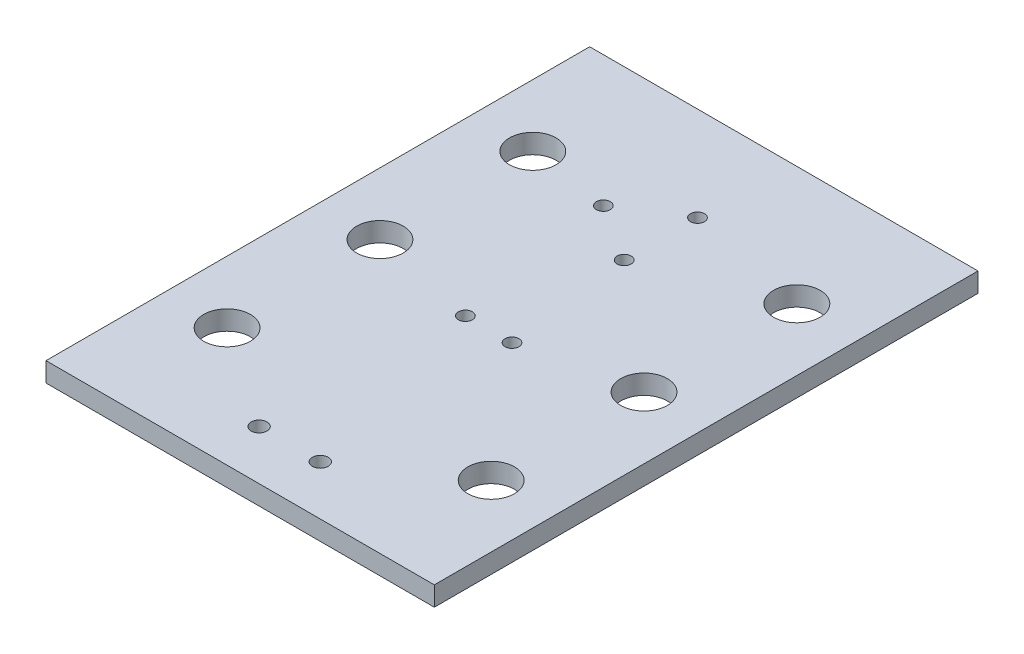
ISO-10303-21;
HEADER;
FILE_DESCRIPTION(('STEP AP214'),'2;1');
FILE_NAME('part.step','',(''),(''),'','','');
FILE_SCHEMA(('AUTOMOTIVE_DESIGN { 1 0 10303 214 1 1 1 1 }'));
ENDSEC;
DATA;
#1=APPLICATION_CONTEXT('core data for automotive mechanical design processes');
#2=APPLICATION_PROTOCOL_DEFINITION('international standard','automotive_design',2000,#1);
#3=PRODUCT_CONTEXT('',#1,'mechanical');
#4=PRODUCT('Part','Part','',(#3));
#5=PRODUCT_RELATED_PRODUCT_CATEGORY('part','',(#4));
#6=PRODUCT_DEFINITION_FORMATION('','',#4);
#7=PRODUCT_DEFINITION_CONTEXT('part definition',#1,'design');
#8=PRODUCT_DEFINITION('design','',#6,#7);
#9=PRODUCT_DEFINITION_SHAPE('','',#8);
#10=(LENGTH_UNIT() NAMED_UNIT(*) SI_UNIT(.MILLI.,.METRE.));
#11=(NAMED_UNIT(*) PLANE_ANGLE_UNIT() SI_UNIT($,.RADIAN.));
#12=(NAMED_UNIT(*) SI_UNIT($,.STERADIAN.) SOLID_ANGLE_UNIT());
#13=UNCERTAINTY_MEASURE_WITH_UNIT(LENGTH_MEASURE(1.E-05),#10,'distance_accuracy_value','');
#14=(GEOMETRIC_REPRESENTATION_CONTEXT(3) GLOBAL_UNCERTAINTY_ASSIGNED_CONTEXT((#13)) GLOBAL_UNIT_ASSIGNED_CONTEXT((#10,
#11,#12)) REPRESENTATION_CONTEXT('',''));
#15=CARTESIAN_POINT('',(0.,0.,0.));
#16=DIRECTION('',(0.,0.,1.));
#17=DIRECTION('',(1.,0.,0.));
#18=AXIS2_PLACEMENT_3D('',#15,#16,#17);
#19=CARTESIAN_POINT('',(0.,1.5875,0.));
#20=DIRECTION('',(0.,1.,0.));
#21=DIRECTION('',(0.,0.,1.));
#22=AXIS2_PLACEMENT_3D('',#19,#20,#21);
#23=PLANE('',#22);
#24=CARTESIAN_POINT('',(10.795,1.5875,-9.72566));
#25=DIRECTION('',(0.,1.,0.));
#26=DIRECTION('',(0.,0.,-1.));
#27=AXIS2_PLACEMENT_3D('',#24,#25,#26);
#28=CIRCLE('',#27,1.905);
#29=CARTESIAN_POINT('',(10.795,1.5875,-11.63066));
#30=VERTEX_POINT('',#29);
#31=EDGE_CURVE('E175',#30,#30,#28,.T.);
#32=ORIENTED_EDGE('',*,*,#31,.F.);
#33=EDGE_LOOP('',(#32));
#34=FACE_BOUND('',#33,.T.);
#35=CARTESIAN_POINT('',(1.90499999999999,1.5875,-20.32));
#36=DIRECTION('',(0.,1.,0.));
#37=DIRECTION('',(0.,0.,-1.));
#38=AXIS2_PLACEMENT_3D('',#35,#36,#37);
#39=CIRCLE('',#38,0.5715);
#40=CARTESIAN_POINT('',(1.90499999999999,1.5875,-20.8915));
#41=VERTEX_POINT('',#40);
#42=EDGE_CURVE('E163',#41,#41,#39,.T.);
#43=ORIENTED_EDGE('',*,*,#42,.F.);
#44=EDGE_LOOP('',(#43));
#45=FACE_BOUND('',#44,.T.);
#46=CARTESIAN_POINT('',(0.635,1.5875,-36.7538));
#47=DIRECTION('',(0.,1.,0.));
#48=DIRECTION('',(0.,0.,1.));
#49=AXIS2_PLACEMENT_3D('',#46,#47,#48);
#50=CIRCLE('',#49,0.571500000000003);
#51=CARTESIAN_POINT('',(0.635,1.5875,-36.1823));
#52=VERTEX_POINT('',#51);
#53=EDGE_CURVE('E151',#52,#52,#50,.T.);
#54=ORIENTED_EDGE('',*,*,#53,.F.);
#55=EDGE_LOOP('',(#54));
#56=FACE_BOUND('',#55,.T.);
#57=CARTESIAN_POINT('',(0.635,1.5875,-30.7594));
#58=DIRECTION('',(0.,1.,0.));
#59=DIRECTION('',(0.,0.,1.));
#60=AXIS2_PLACEMENT_3D('',#57,#58,#59);
#61=CIRCLE('',#60,0.5715);
#62=CARTESIAN_POINT('',(0.635,1.5875,-30.1879));
#63=VERTEX_POINT('',#62);
#64=EDGE_CURVE('E139',#63,#63,#61,.T.);
#65=ORIENTED_EDGE('',*,*,#64,.F.);
#66=EDGE_LOOP('',(#65));
#67=FACE_BOUND('',#66,.T.);
#68=CARTESIAN_POINT('',(-2.49936,1.5875,-4.04876));
#69=DIRECTION('',(0.,1.,0.));
#70=DIRECTION('',(0.,0.,1.));
#71=AXIS2_PLACEMENT_3D('',#68,#69,#70);
#72=CIRCLE('',#71,0.6477);
#73=CARTESIAN_POINT('',(-2.49936,1.5875,-3.40106));
#74=VERTEX_POINT('',#73);
#75=EDGE_CURVE('E127',#74,#74,#72,.T.);
#76=ORIENTED_EDGE('',*,*,#75,.F.);
#77=EDGE_LOOP('',(#76));
#78=FACE_BOUND('',#77,.T.);
#79=CARTESIAN_POINT('',(-10.795,1.5875,-22.225));
#80=DIRECTION('',(0.,1.,0.));
#81=DIRECTION('',(0.,0.,1.));
#82=AXIS2_PLACEMENT_3D('',#79,#80,#81);
#83=CIRCLE('',#82,1.905);
#84=CARTESIAN_POINT('',(-10.795,1.5875,-20.32));
#85=VERTEX_POINT('',#84);
#86=EDGE_CURVE('E115',#85,#85,#83,.T.);
#87=ORIENTED_EDGE('',*,*,#86,.F.);
#88=EDGE_LOOP('',(#87));
#89=FACE_BOUND('',#88,.T.);
#90=DIRECTION('',(0.,0.,1.));
#91=VECTOR('',#90,1.);
#92=CARTESIAN_POINT('',(-15.875,1.5875,-44.45));
#93=LINE('',#92,#91);
#94=CARTESIAN_POINT('',(-15.875,1.5875,-44.45));
#95=VERTEX_POINT('',#94);
#96=CARTESIAN_POINT('',(-15.875,1.5875,0.));
#97=VERTEX_POINT('',#96);
#98=EDGE_CURVE('E85',#95,#97,#93,.T.);
#99=ORIENTED_EDGE('',*,*,#98,.T.);
#100=DIRECTION('',(1.,0.,0.));
#101=VECTOR('',#100,1.);
#102=CARTESIAN_POINT('',(-15.875,1.5875,0.));
#103=LINE('',#102,#101);
#104=CARTESIAN_POINT('',(15.875,1.5875,0.));
#105=VERTEX_POINT('',#104);
#106=EDGE_CURVE('E80',#97,#105,#103,.T.);
#107=ORIENTED_EDGE('',*,*,#106,.T.);
#108=DIRECTION('',(0.,0.,-1.));
#109=VECTOR('',#108,1.);
#110=CARTESIAN_POINT('',(15.875,1.5875,-44.45));
#111=LINE('',#110,#109);
#112=CARTESIAN_POINT('',(15.875,1.5875,-44.45));
#113=VERTEX_POINT('',#112);
#114=EDGE_CURVE('E83',#105,#113,#111,.T.);
#115=ORIENTED_EDGE('',*,*,#114,.T.);
#116=DIRECTION('',(-1.,0.,0.));
#117=VECTOR('',#116,1.);
#118=CARTESIAN_POINT('',(-15.875,1.5875,-44.45));
#119=LINE('',#118,#117);
#120=EDGE_CURVE('E50',#113,#95,#119,.T.);
#121=ORIENTED_EDGE('',*,*,#120,.T.);
#122=EDGE_LOOP('',(#99,#107,#115,#121));
#123=FACE_BOUND('',#122,.T.);
#124=CARTESIAN_POINT('',(-10.795,1.5875,-9.72566));
#125=DIRECTION('',(0.,1.,0.));
#126=DIRECTION('',(0.,0.,1.));
#127=AXIS2_PLACEMENT_3D('',#124,#125,#126);
#128=CIRCLE('',#127,1.905);
#129=CARTESIAN_POINT('',(-10.795,1.5875,-7.82066));
#130=VERTEX_POINT('',#129);
#131=EDGE_CURVE('E100',#130,#130,#128,.T.);
#132=ORIENTED_EDGE('',*,*,#131,.F.);
#133=EDGE_LOOP('',(#132));
#134=FACE_BOUND('',#133,.T.);
#135=CARTESIAN_POINT('',(-10.795,1.5875,-34.7218));
#136=DIRECTION('',(0.,1.,0.));
#137=DIRECTION('',(0.,0.,1.));
#138=AXIS2_PLACEMENT_3D('',#135,#136,#137);
#139=CIRCLE('',#138,1.905);
#140=CARTESIAN_POINT('',(-10.795,1.5875,-32.8168));
#141=VERTEX_POINT('',#140);
#142=EDGE_CURVE('E121',#141,#141,#139,.T.);
#143=ORIENTED_EDGE('',*,*,#142,.F.);
#144=EDGE_LOOP('',(#143));
#145=FACE_BOUND('',#144,.T.);
#146=CARTESIAN_POINT('',(-1.905,1.5875,-20.32));
#147=DIRECTION('',(0.,1.,0.));
#148=DIRECTION('',(0.,0.,1.));
#149=AXIS2_PLACEMENT_3D('',#146,#147,#148);
#150=CIRCLE('',#149,0.5715);
#151=CARTESIAN_POINT('',(-1.905,1.5875,-19.7485));
#152=VERTEX_POINT('',#151);
#153=EDGE_CURVE('E133',#152,#152,#150,.T.);
#154=ORIENTED_EDGE('',*,*,#153,.F.);
#155=EDGE_LOOP('',(#154));
#156=FACE_BOUND('',#155,.T.);
#157=CARTESIAN_POINT('',(-4.064,1.5875,-33.7566));
#158=DIRECTION('',(0.,1.,0.));
#159=DIRECTION('',(0.,0.,1.));
#160=AXIS2_PLACEMENT_3D('',#157,#158,#159);
#161=CIRCLE('',#160,0.571500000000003);
#162=CARTESIAN_POINT('',(-4.064,1.5875,-33.1851));
#163=VERTEX_POINT('',#162);
#164=EDGE_CURVE('E145',#163,#163,#161,.T.);
#165=ORIENTED_EDGE('',*,*,#164,.F.);
#166=EDGE_LOOP('',(#165));
#167=FACE_BOUND('',#166,.T.);
#168=CARTESIAN_POINT('',(10.795,1.5875,-34.7218));
#169=DIRECTION('',(0.,1.,0.));
#170=DIRECTION('',(0.,0.,-1.));
#171=AXIS2_PLACEMENT_3D('',#168,#169,#170);
#172=CIRCLE('',#171,1.905);
#173=CARTESIAN_POINT('',(10.795,1.5875,-36.6268));
#174=VERTEX_POINT('',#173);
#175=EDGE_CURVE('E157',#174,#174,#172,.T.);
#176=ORIENTED_EDGE('',*,*,#175,.F.);
#177=EDGE_LOOP('',(#176));
#178=FACE_BOUND('',#177,.T.);
#179=CARTESIAN_POINT('',(10.795,1.5875,-22.225));
#180=DIRECTION('',(0.,1.,0.));
#181=DIRECTION('',(0.,0.,-1.));
#182=AXIS2_PLACEMENT_3D('',#179,#180,#181);
#183=CIRCLE('',#182,1.905);
#184=CARTESIAN_POINT('',(10.795,1.5875,-24.13));
#185=VERTEX_POINT('',#184);
#186=EDGE_CURVE('E169',#185,#185,#183,.T.);
#187=ORIENTED_EDGE('',*,*,#186,.F.);
#188=EDGE_LOOP('',(#187));
#189=FACE_BOUND('',#188,.T.);
#190=CARTESIAN_POINT('',(2.49936,1.5875,-4.04876));
#191=DIRECTION('',(0.,1.,0.));
#192=DIRECTION('',(0.,0.,-1.));
#193=AXIS2_PLACEMENT_3D('',#190,#191,#192);
#194=CIRCLE('',#193,0.647700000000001);
#195=CARTESIAN_POINT('',(2.49936,1.5875,-4.69646));
#196=VERTEX_POINT('',#195);
#197=EDGE_CURVE('E181',#196,#196,#194,.T.);
#198=ORIENTED_EDGE('',*,*,#197,.F.);
#199=EDGE_LOOP('',(#198));
#200=FACE_BOUND('',#199,.T.);
#201=ADVANCED_FACE('F33',(#34,#45,#56,#67,#78,#89,#123,#134,#145,#156,#167,#178,#189,#200),#23,.T.);
#202=CARTESIAN_POINT('',(0.,0.,0.));
#203=DIRECTION('',(0.,1.,0.));
#204=DIRECTION('',(0.,0.,1.));
#205=AXIS2_PLACEMENT_3D('',#202,#203,#204);
#206=PLANE('',#205);
#207=CARTESIAN_POINT('',(10.795,0.,-9.72566));
#208=DIRECTION('',(0.,1.,0.));
#209=DIRECTION('',(0.,0.,-1.));
#210=AXIS2_PLACEMENT_3D('',#207,#208,#209);
#211=CIRCLE('',#210,1.905);
#212=CARTESIAN_POINT('',(10.795,0.,-11.63066));
#213=VERTEX_POINT('',#212);
#214=EDGE_CURVE('E178',#213,#213,#211,.T.);
#215=ORIENTED_EDGE('',*,*,#214,.T.);
#216=EDGE_LOOP('',(#215));
#217=FACE_BOUND('',#216,.T.);
#218=CARTESIAN_POINT('',(1.90499999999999,0.,-20.32));
#219=DIRECTION('',(0.,1.,0.));
#220=DIRECTION('',(0.,0.,-1.));
#221=AXIS2_PLACEMENT_3D('',#218,#219,#220);
#222=CIRCLE('',#221,0.5715);
#223=CARTESIAN_POINT('',(1.90499999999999,0.,-20.8915));
#224=VERTEX_POINT('',#223);
#225=EDGE_CURVE('E166',#224,#224,#222,.T.);
#226=ORIENTED_EDGE('',*,*,#225,.T.);
#227=EDGE_LOOP('',(#226));
#228=FACE_BOUND('',#227,.T.);
#229=CARTESIAN_POINT('',(0.635,0.,-36.7538));
#230=DIRECTION('',(0.,1.,0.));
#231=DIRECTION('',(0.,0.,1.));
#232=AXIS2_PLACEMENT_3D('',#229,#230,#231);
#233=CIRCLE('',#232,0.571500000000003);
#234=CARTESIAN_POINT('',(0.635,0.,-36.1823));
#235=VERTEX_POINT('',#234);
#236=EDGE_CURVE('E154',#235,#235,#233,.T.);
#237=ORIENTED_EDGE('',*,*,#236,.T.);
#238=EDGE_LOOP('',(#237));
#239=FACE_BOUND('',#238,.T.);
#240=CARTESIAN_POINT('',(0.635,0.,-30.7594));
#241=DIRECTION('',(0.,1.,0.));
#242=DIRECTION('',(0.,0.,1.));
#243=AXIS2_PLACEMENT_3D('',#240,#241,#242);
#244=CIRCLE('',#243,0.5715);
#245=CARTESIAN_POINT('',(0.635,0.,-30.1879));
#246=VERTEX_POINT('',#245);
#247=EDGE_CURVE('E142',#246,#246,#244,.T.);
#248=ORIENTED_EDGE('',*,*,#247,.T.);
#249=EDGE_LOOP('',(#248));
#250=FACE_BOUND('',#249,.T.);
#251=CARTESIAN_POINT('',(-2.49936,0.,-4.04876));
#252=DIRECTION('',(0.,1.,0.));
#253=DIRECTION('',(0.,0.,1.));
#254=AXIS2_PLACEMENT_3D('',#251,#252,#253);
#255=CIRCLE('',#254,0.6477);
#256=CARTESIAN_POINT('',(-2.49936,0.,-3.40106));
#257=VERTEX_POINT('',#256);
#258=EDGE_CURVE('E130',#257,#257,#255,.T.);
#259=ORIENTED_EDGE('',*,*,#258,.T.);
#260=EDGE_LOOP('',(#259));
#261=FACE_BOUND('',#260,.T.);
#262=CARTESIAN_POINT('',(-10.795,0.,-22.225));
#263=DIRECTION('',(0.,1.,0.));
#264=DIRECTION('',(0.,0.,1.));
#265=AXIS2_PLACEMENT_3D('',#262,#263,#264);
#266=CIRCLE('',#265,1.905);
#267=CARTESIAN_POINT('',(-10.795,0.,-20.32));
#268=VERTEX_POINT('',#267);
#269=EDGE_CURVE('E118',#268,#268,#266,.T.);
#270=ORIENTED_EDGE('',*,*,#269,.T.);
#271=EDGE_LOOP('',(#270));
#272=FACE_BOUND('',#271,.T.);
#273=DIRECTION('',(0.,0.,1.));
#274=VECTOR('',#273,1.);
#275=CARTESIAN_POINT('',(-15.875,0.,-44.45));
#276=LINE('',#275,#274);
#277=CARTESIAN_POINT('',(-15.875,0.,-44.45));
#278=VERTEX_POINT('',#277);
#279=CARTESIAN_POINT('',(-15.875,0.,0.));
#280=VERTEX_POINT('',#279);
#281=EDGE_CURVE('E97',#278,#280,#276,.T.);
#282=ORIENTED_EDGE('',*,*,#281,.F.);
#283=DIRECTION('',(-1.,0.,0.));
#284=VECTOR('',#283,1.);
#285=CARTESIAN_POINT('',(-15.875,0.,-44.45));
#286=LINE('',#285,#284);
#287=CARTESIAN_POINT('',(15.875,0.,-44.45));
#288=VERTEX_POINT('',#287);
#289=EDGE_CURVE('E73',#288,#278,#286,.T.);
#290=ORIENTED_EDGE('',*,*,#289,.F.);
#291=DIRECTION('',(0.,0.,-1.));
#292=VECTOR('',#291,1.);
#293=CARTESIAN_POINT('',(15.875,0.,-44.45));
#294=LINE('',#293,#292);
#295=CARTESIAN_POINT('',(15.875,0.,0.));
#296=VERTEX_POINT('',#295);
#297=EDGE_CURVE('E67',#296,#288,#294,.T.);
#298=ORIENTED_EDGE('',*,*,#297,.F.);
#299=DIRECTION('',(1.,0.,0.));
#300=VECTOR('',#299,1.);
#301=CARTESIAN_POINT('',(-15.875,0.,0.));
#302=LINE('',#301,#300);
#303=EDGE_CURVE('E89',#280,#296,#302,.T.);
#304=ORIENTED_EDGE('',*,*,#303,.F.);
#305=EDGE_LOOP('',(#282,#290,#298,#304));
#306=FACE_BOUND('',#305,.T.);
#307=CARTESIAN_POINT('',(-10.795,0.,-9.72566));
#308=DIRECTION('',(0.,1.,0.));
#309=DIRECTION('',(0.,0.,1.));
#310=AXIS2_PLACEMENT_3D('',#307,#308,#309);
#311=CIRCLE('',#310,1.905);
#312=CARTESIAN_POINT('',(-10.795,0.,-7.82066));
#313=VERTEX_POINT('',#312);
#314=EDGE_CURVE('E112',#313,#313,#311,.T.);
#315=ORIENTED_EDGE('',*,*,#314,.T.);
#316=EDGE_LOOP('',(#315));
#317=FACE_BOUND('',#316,.T.);
#318=CARTESIAN_POINT('',(-10.795,0.,-34.7218));
#319=DIRECTION('',(0.,1.,0.));
#320=DIRECTION('',(0.,0.,1.));
#321=AXIS2_PLACEMENT_3D('',#318,#319,#320);
#322=CIRCLE('',#321,1.905);
#323=CARTESIAN_POINT('',(-10.795,0.,-32.8168));
#324=VERTEX_POINT('',#323);
#325=EDGE_CURVE('E124',#324,#324,#322,.T.);
#326=ORIENTED_EDGE('',*,*,#325,.T.);
#327=EDGE_LOOP('',(#326));
#328=FACE_BOUND('',#327,.T.);
#329=CARTESIAN_POINT('',(-1.905,0.,-20.32));
#330=DIRECTION('',(0.,1.,0.));
#331=DIRECTION('',(0.,0.,1.));
#332=AXIS2_PLACEMENT_3D('',#329,#330,#331);
#333=CIRCLE('',#332,0.5715);
#334=CARTESIAN_POINT('',(-1.905,0.,-19.7485));
#335=VERTEX_POINT('',#334);
#336=EDGE_CURVE('E136',#335,#335,#333,.T.);
#337=ORIENTED_EDGE('',*,*,#336,.T.);
#338=EDGE_LOOP('',(#337));
#339=FACE_BOUND('',#338,.T.);
#340=CARTESIAN_POINT('',(-4.064,0.,-33.7566));
#341=DIRECTION('',(0.,1.,0.));
#342=DIRECTION('',(0.,0.,1.));
#343=AXIS2_PLACEMENT_3D('',#340,#341,#342);
#344=CIRCLE('',#343,0.571500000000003);
#345=CARTESIAN_POINT('',(-4.064,0.,-33.1851));
#346=VERTEX_POINT('',#345);
#347=EDGE_CURVE('E148',#346,#346,#344,.T.);
#348=ORIENTED_EDGE('',*,*,#347,.T.);
#349=EDGE_LOOP('',(#348));
#350=FACE_BOUND('',#349,.T.);
#351=CARTESIAN_POINT('',(10.795,0.,-34.7218));
#352=DIRECTION('',(0.,1.,0.));
#353=DIRECTION('',(0.,0.,-1.));
#354=AXIS2_PLACEMENT_3D('',#351,#352,#353);
#355=CIRCLE('',#354,1.905);
#356=CARTESIAN_POINT('',(10.795,0.,-36.6268));
#357=VERTEX_POINT('',#356);
#358=EDGE_CURVE('E160',#357,#357,#355,.T.);
#359=ORIENTED_EDGE('',*,*,#358,.T.);
#360=EDGE_LOOP('',(#359));
#361=FACE_BOUND('',#360,.T.);
#362=CARTESIAN_POINT('',(10.795,0.,-22.225));
#363=DIRECTION('',(0.,1.,0.));
#364=DIRECTION('',(0.,0.,-1.));
#365=AXIS2_PLACEMENT_3D('',#362,#363,#364);
#366=CIRCLE('',#365,1.905);
#367=CARTESIAN_POINT('',(10.795,0.,-24.13));
#368=VERTEX_POINT('',#367);
#369=EDGE_CURVE('E172',#368,#368,#366,.T.);
#370=ORIENTED_EDGE('',*,*,#369,.T.);
#371=EDGE_LOOP('',(#370));
#372=FACE_BOUND('',#371,.T.);
#373=CARTESIAN_POINT('',(2.49936,0.,-4.04876));
#374=DIRECTION('',(0.,1.,0.));
#375=DIRECTION('',(0.,0.,-1.));
#376=AXIS2_PLACEMENT_3D('',#373,#374,#375);
#377=CIRCLE('',#376,0.647700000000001);
#378=CARTESIAN_POINT('',(2.49936,0.,-4.69646));
#379=VERTEX_POINT('',#378);
#380=EDGE_CURVE('E184',#379,#379,#377,.T.);
#381=ORIENTED_EDGE('',*,*,#380,.T.);
#382=EDGE_LOOP('',(#381));
#383=FACE_BOUND('',#382,.T.);
#384=ADVANCED_FACE('F108',(#217,#228,#239,#250,#261,#272,#306,#317,#328,#339,#350,#361,#372,
#383),#206,.F.);
#385=CARTESIAN_POINT('',(-15.875,1.5875,-44.45));
#386=DIRECTION('',(1.,0.,0.));
#387=DIRECTION('',(0.,0.,-1.));
#388=AXIS2_PLACEMENT_3D('',#385,#386,#387);
#389=PLANE('',#388);
#390=ORIENTED_EDGE('',*,*,#281,.T.);
#391=DIRECTION('',(0.,-1.,0.));
#392=VECTOR('',#391,1.);
#393=CARTESIAN_POINT('',(-15.875,1.5875,0.));
#394=LINE('',#393,#392);
#395=EDGE_CURVE('E11',#97,#280,#394,.T.);
#396=ORIENTED_EDGE('',*,*,#395,.F.);
#397=ORIENTED_EDGE('',*,*,#98,.F.);
#398=DIRECTION('',(0.,-1.,0.));
#399=VECTOR('',#398,1.);
#400=CARTESIAN_POINT('',(-15.875,1.5875,-44.45));
#401=LINE('',#400,#399);
#402=EDGE_CURVE('E93',#95,#278,#401,.T.);
#403=ORIENTED_EDGE('',*,*,#402,.T.);
#404=EDGE_LOOP('',(#390,#396,#397,#403));
#405=FACE_BOUND('',#404,.T.);
#406=ADVANCED_FACE('F35',(#405),#389,.F.);
#407=CARTESIAN_POINT('',(-15.875,1.5875,0.));
#408=DIRECTION('',(0.,0.,-1.));
#409=DIRECTION('',(-1.,0.,0.));
#410=AXIS2_PLACEMENT_3D('',#407,#408,#409);
#411=PLANE('',#410);
#412=ORIENTED_EDGE('',*,*,#303,.T.);
#413=DIRECTION('',(0.,-1.,0.));
#414=VECTOR('',#413,1.);
#415=CARTESIAN_POINT('',(15.875,1.5875,0.));
#416=LINE('',#415,#414);
#417=EDGE_CURVE('E42',#105,#296,#416,.T.);
#418=ORIENTED_EDGE('',*,*,#417,.F.);
#419=ORIENTED_EDGE('',*,*,#106,.F.);
#420=ORIENTED_EDGE('',*,*,#395,.T.);
#421=EDGE_LOOP('',(#412,#418,#419,#420));
#422=FACE_BOUND('',#421,.T.);
#423=ADVANCED_FACE('F88',(#422),#411,.F.);
#424=CARTESIAN_POINT('',(15.875,1.5875,-44.45));
#425=DIRECTION('',(-1.,0.,0.));
#426=DIRECTION('',(0.,0.,1.));
#427=AXIS2_PLACEMENT_3D('',#424,#425,#426);
#428=PLANE('',#427);
#429=ORIENTED_EDGE('',*,*,#297,.T.);
#430=DIRECTION('',(0.,-1.,0.));
#431=VECTOR('',#430,1.);
#432=CARTESIAN_POINT('',(15.875,1.5875,-44.45));
#433=LINE('',#432,#431);
#434=EDGE_CURVE('E90',#113,#288,#433,.T.);
#435=ORIENTED_EDGE('',*,*,#434,.F.);
#436=ORIENTED_EDGE('',*,*,#114,.F.);
#437=ORIENTED_EDGE('',*,*,#417,.T.);
#438=EDGE_LOOP('',(#429,#435,#436,#437));
#439=FACE_BOUND('',#438,.T.);
#440=ADVANCED_FACE('F91',(#439),#428,.F.);
#441=CARTESIAN_POINT('',(-15.875,1.5875,-44.45));
#442=DIRECTION('',(0.,0.,1.));
#443=DIRECTION('',(1.,0.,0.));
#444=AXIS2_PLACEMENT_3D('',#441,#442,#443);
#445=PLANE('',#444);
#446=ORIENTED_EDGE('',*,*,#289,.T.);
#447=ORIENTED_EDGE('',*,*,#402,.F.);
#448=ORIENTED_EDGE('',*,*,#120,.F.);
#449=ORIENTED_EDGE('',*,*,#434,.T.);
#450=EDGE_LOOP('',(#446,#447,#448,#449));
#451=FACE_BOUND('',#450,.T.);
#452=ADVANCED_FACE('F105',(#451),#445,.F.);
#453=CARTESIAN_POINT('',(-10.795,1.5875,-9.72566));
#454=DIRECTION('',(0.,-1.,0.));
#455=DIRECTION('',(0.,0.,-1.));
#456=AXIS2_PLACEMENT_3D('',#453,#454,#455);
#457=CYLINDRICAL_SURFACE('',#456,1.905);
#458=ORIENTED_EDGE('',*,*,#131,.T.);
#459=EDGE_LOOP('',(#458));
#460=FACE_BOUND('',#459,.T.);
#461=ORIENTED_EDGE('',*,*,#314,.F.);
#462=EDGE_LOOP('',(#461));
#463=FACE_BOUND('',#462,.T.);
#464=ADVANCED_FACE('F204',(#460,#463),#457,.F.);
#465=CARTESIAN_POINT('',(-10.795,1.5875,-22.225));
#466=DIRECTION('',(0.,-1.,0.));
#467=DIRECTION('',(0.,0.,-1.));
#468=AXIS2_PLACEMENT_3D('',#465,#466,#467);
#469=CYLINDRICAL_SURFACE('',#468,1.905);
#470=ORIENTED_EDGE('',*,*,#86,.T.);
#471=EDGE_LOOP('',(#470));
#472=FACE_BOUND('',#471,.T.);
#473=ORIENTED_EDGE('',*,*,#269,.F.);
#474=EDGE_LOOP('',(#473));
#475=FACE_BOUND('',#474,.T.);
#476=ADVANCED_FACE('F250',(#472,#475),#469,.F.);
#477=CARTESIAN_POINT('',(-10.795,1.5875,-34.7218));
#478=DIRECTION('',(0.,-1.,0.));
#479=DIRECTION('',(0.,0.,-1.));
#480=AXIS2_PLACEMENT_3D('',#477,#478,#479);
#481=CYLINDRICAL_SURFACE('',#480,1.905);
#482=ORIENTED_EDGE('',*,*,#142,.T.);
#483=EDGE_LOOP('',(#482));
#484=FACE_BOUND('',#483,.T.);
#485=ORIENTED_EDGE('',*,*,#325,.F.);
#486=EDGE_LOOP('',(#485));
#487=FACE_BOUND('',#486,.T.);
#488=ADVANCED_FACE('F258',(#484,#487),#481,.F.);
#489=CARTESIAN_POINT('',(-2.49936,1.5875,-4.04876));
#490=DIRECTION('',(0.,-1.,0.));
#491=DIRECTION('',(0.,0.,-1.));
#492=AXIS2_PLACEMENT_3D('',#489,#490,#491);
#493=CYLINDRICAL_SURFACE('',#492,0.6477);
#494=ORIENTED_EDGE('',*,*,#75,.T.);
#495=EDGE_LOOP('',(#494));
#496=FACE_BOUND('',#495,.T.);
#497=ORIENTED_EDGE('',*,*,#258,.F.);
#498=EDGE_LOOP('',(#497));
#499=FACE_BOUND('',#498,.T.);
#500=ADVANCED_FACE('F266',(#496,#499),#493,.F.);
#501=CARTESIAN_POINT('',(-1.905,1.5875,-20.32));
#502=DIRECTION('',(0.,-1.,0.));
#503=DIRECTION('',(0.,0.,-1.));
#504=AXIS2_PLACEMENT_3D('',#501,#502,#503);
#505=CYLINDRICAL_SURFACE('',#504,0.5715);
#506=ORIENTED_EDGE('',*,*,#153,.T.);
#507=EDGE_LOOP('',(#506));
#508=FACE_BOUND('',#507,.T.);
#509=ORIENTED_EDGE('',*,*,#336,.F.);
#510=EDGE_LOOP('',(#509));
#511=FACE_BOUND('',#510,.T.);
#512=ADVANCED_FACE('F275',(#508,#511),#505,.F.);
#513=CARTESIAN_POINT('',(0.635,1.5875,-30.7594));
#514=DIRECTION('',(0.,-1.,0.));
#515=DIRECTION('',(0.,0.,-1.));
#516=AXIS2_PLACEMENT_3D('',#513,#514,#515);
#517=CYLINDRICAL_SURFACE('',#516,0.5715);
#518=ORIENTED_EDGE('',*,*,#64,.T.);
#519=EDGE_LOOP('',(#518));
#520=FACE_BOUND('',#519,.T.);
#521=ORIENTED_EDGE('',*,*,#247,.F.);
#522=EDGE_LOOP('',(#521));
#523=FACE_BOUND('',#522,.T.);
#524=ADVANCED_FACE('F284',(#520,#523),#517,.F.);
#525=CARTESIAN_POINT('',(-4.064,1.5875,-33.7566));
#526=DIRECTION('',(0.,-1.,0.));
#527=DIRECTION('',(0.,0.,-1.));
#528=AXIS2_PLACEMENT_3D('',#525,#526,#527);
#529=CYLINDRICAL_SURFACE('',#528,0.571500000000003);
#530=ORIENTED_EDGE('',*,*,#164,.T.);
#531=EDGE_LOOP('',(#530));
#532=FACE_BOUND('',#531,.T.);
#533=ORIENTED_EDGE('',*,*,#347,.F.);
#534=EDGE_LOOP('',(#533));
#535=FACE_BOUND('',#534,.T.);
#536=ADVANCED_FACE('F293',(#532,#535),#529,.F.);
#537=CARTESIAN_POINT('',(0.635,1.5875,-36.7538));
#538=DIRECTION('',(0.,-1.,0.));
#539=DIRECTION('',(0.,0.,-1.));
#540=AXIS2_PLACEMENT_3D('',#537,#538,#539);
#541=CYLINDRICAL_SURFACE('',#540,0.571500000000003);
#542=ORIENTED_EDGE('',*,*,#53,.T.);
#543=EDGE_LOOP('',(#542));
#544=FACE_BOUND('',#543,.T.);
#545=ORIENTED_EDGE('',*,*,#236,.F.);
#546=EDGE_LOOP('',(#545));
#547=FACE_BOUND('',#546,.T.);
#548=ADVANCED_FACE('F302',(#544,#547),#541,.F.);
#549=CARTESIAN_POINT('',(10.795,1.5875,-34.7218));
#550=DIRECTION('',(0.,-1.,0.));
#551=DIRECTION('',(0.,0.,-1.));
#552=AXIS2_PLACEMENT_3D('',#549,#550,#551);
#553=CYLINDRICAL_SURFACE('',#552,1.905);
#554=ORIENTED_EDGE('',*,*,#175,.T.);
#555=EDGE_LOOP('',(#554));
#556=FACE_BOUND('',#555,.T.);
#557=ORIENTED_EDGE('',*,*,#358,.F.);
#558=EDGE_LOOP('',(#557));
#559=FACE_BOUND('',#558,.T.);
#560=ADVANCED_FACE('F311',(#556,#559),#553,.F.);
#561=CARTESIAN_POINT('',(1.90499999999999,1.5875,-20.32));
#562=DIRECTION('',(0.,-1.,0.));
#563=DIRECTION('',(0.,0.,-1.));
#564=AXIS2_PLACEMENT_3D('',#561,#562,#563);
#565=CYLINDRICAL_SURFACE('',#564,0.5715);
#566=ORIENTED_EDGE('',*,*,#42,.T.);
#567=EDGE_LOOP('',(#566));
#568=FACE_BOUND('',#567,.T.);
#569=ORIENTED_EDGE('',*,*,#225,.F.);
#570=EDGE_LOOP('',(#569));
#571=FACE_BOUND('',#570,.T.);
#572=ADVANCED_FACE('F320',(#568,#571),#565,.F.);
#573=CARTESIAN_POINT('',(10.795,1.5875,-22.225));
#574=DIRECTION('',(0.,-1.,0.));
#575=DIRECTION('',(0.,0.,-1.));
#576=AXIS2_PLACEMENT_3D('',#573,#574,#575);
#577=CYLINDRICAL_SURFACE('',#576,1.905);
#578=ORIENTED_EDGE('',*,*,#186,.T.);
#579=EDGE_LOOP('',(#578));
#580=FACE_BOUND('',#579,.T.);
#581=ORIENTED_EDGE('',*,*,#369,.F.);
#582=EDGE_LOOP('',(#581));
#583=FACE_BOUND('',#582,.T.);
#584=ADVANCED_FACE('F329',(#580,#583),#577,.F.);
#585=CARTESIAN_POINT('',(10.795,1.5875,-9.72566));
#586=DIRECTION('',(0.,-1.,0.));
#587=DIRECTION('',(0.,0.,-1.));
#588=AXIS2_PLACEMENT_3D('',#585,#586,#587);
#589=CYLINDRICAL_SURFACE('',#588,1.905);
#590=ORIENTED_EDGE('',*,*,#31,.T.);
#591=EDGE_LOOP('',(#590));
#592=FACE_BOUND('',#591,.T.);
#593=ORIENTED_EDGE('',*,*,#214,.F.);
#594=EDGE_LOOP('',(#593));
#595=FACE_BOUND('',#594,.T.);
#596=ADVANCED_FACE('F338',(#592,#595),#589,.F.);
#597=CARTESIAN_POINT('',(2.49936,1.5875,-4.04876));
#598=DIRECTION('',(0.,-1.,0.));
#599=DIRECTION('',(0.,0.,-1.));
#600=AXIS2_PLACEMENT_3D('',#597,#598,#599);
#601=CYLINDRICAL_SURFACE('',#600,0.647700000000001);
#602=ORIENTED_EDGE('',*,*,#197,.T.);
#603=EDGE_LOOP('',(#602));
#604=FACE_BOUND('',#603,.T.);
#605=ORIENTED_EDGE('',*,*,#380,.F.);
#606=EDGE_LOOP('',(#605));
#607=FACE_BOUND('',#606,.T.);
#608=ADVANCED_FACE('F190',(#604,#607),#601,.F.);
#609=CLOSED_SHELL('',(#201,#384,#406,#423,#440,#452,#464,#476,#488,#500,#512,#524,#536,#548,
#560,#572,#584,#596,#608));
#610=MANIFOLD_SOLID_BREP('B2',#609);
#611=ADVANCED_BREP_SHAPE_REPRESENTATION('',(#18,#610),#14);
#612=SHAPE_DEFINITION_REPRESENTATION(#9,#611);
ENDSEC;
END-ISO-10303-21;
